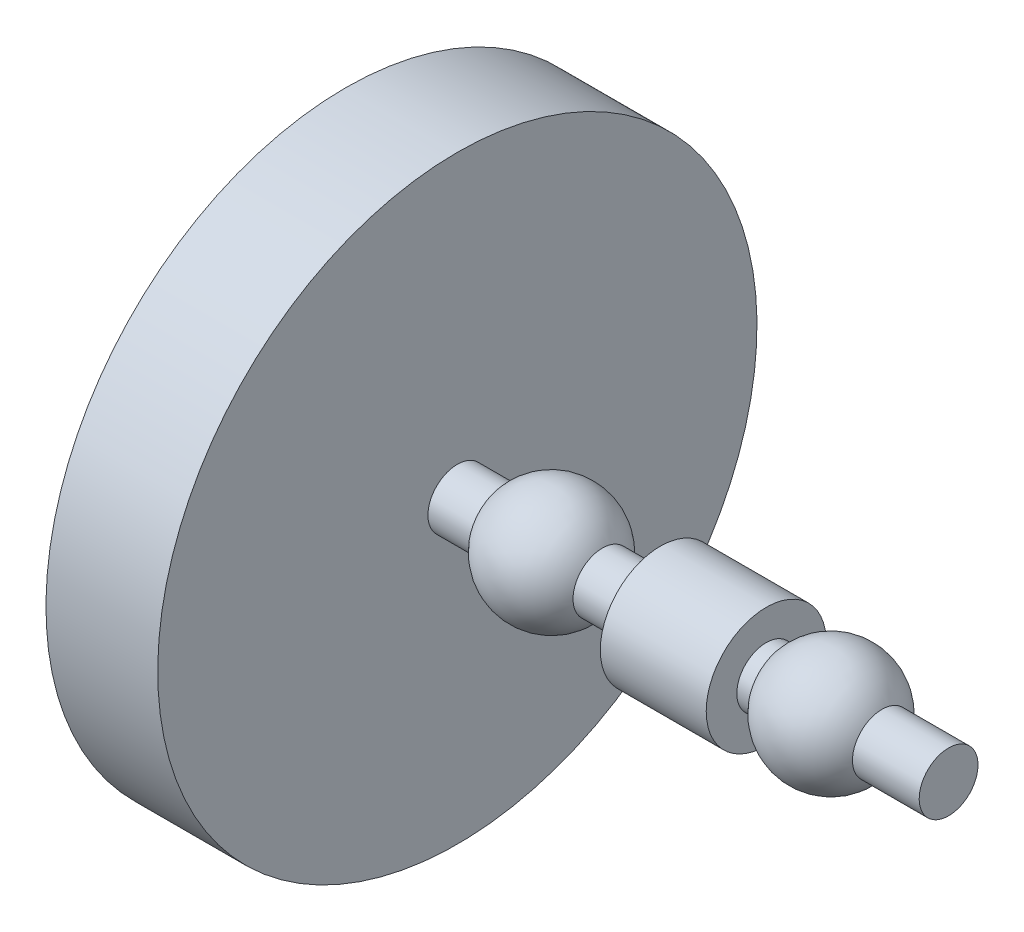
from build123d import *

# Parameters (mm, degrees)
ESQUISSE2_W             = 18
ESQUISSE2_H             = 10.2
ENL_V_MAT_EXTRU_1_DEPTH = 3


with BuildPart() as part:
    # Esquisse1 → R_volution2 (revolve)
    with BuildSketch(Plane.XY):
        with BuildLine():
            Line((8.660254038, 5), (38.839745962, 5))
            ThreePointArc((38.839745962, 5), (47.5, 10), (56.160254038, 5))
            Line((56.160254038, 5), (67.5, 5))
            Line((67.5, 5), (67.5, 0))
            Line((67.5, 0), (47.5, 0))
            Line((47.5, 0), (0, 0))
            Line((0, 0), (-35, 0))
            Line((-35, 0), (-35, 50.93))
            Line((-35, 50.93), (-16, 50.93))
            Line((-16, 50.93), (-16, 5))
            Line((-16, 5), (-8.660254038, 5))
            ThreePointArc((-8.660254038, 5), (0, 10), (8.660254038, 5))
        make_face()
    revolve(axis=Axis((0, 0, 0), (-1, 0, 0)))

    # Esquisse2 → R_volution3 (revolve)
    with BuildSketch(Plane.XY):
        with Locations((27.5, 5.1)):
            Rectangle(ESQUISSE2_W, ESQUISSE2_H)
    revolve(axis=Axis((0, 0, 0), (1, 0, 0)))

    # Esquisse3 → Enl_v. mat.-Extru.1 (cut)
    with BuildSketch(Plane.ZY.offset(35)):
        with BuildLine():
            Line((40, 3), (9, 3))
            ThreePointArc((9, 3), (7.585786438, 2.414213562), (7, 1))
            Line((7, 1), (7, -1))
            ThreePointArc((7, -1), (7.585786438, -2.414213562), (9, -3))
            Line((9, -3), (40, -3))
            ThreePointArc((40, -3), (41.414213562, -2.414213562), (42, -1))
            Line((42, -1), (42, 1))
            ThreePointArc((42, 1), (41.414213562, 2.414213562), (40, 3))
        make_face()
    extrude(amount=-ENL_V_MAT_EXTRU_1_DEPTH, mode=Mode.SUBTRACT)


solid = part.part
